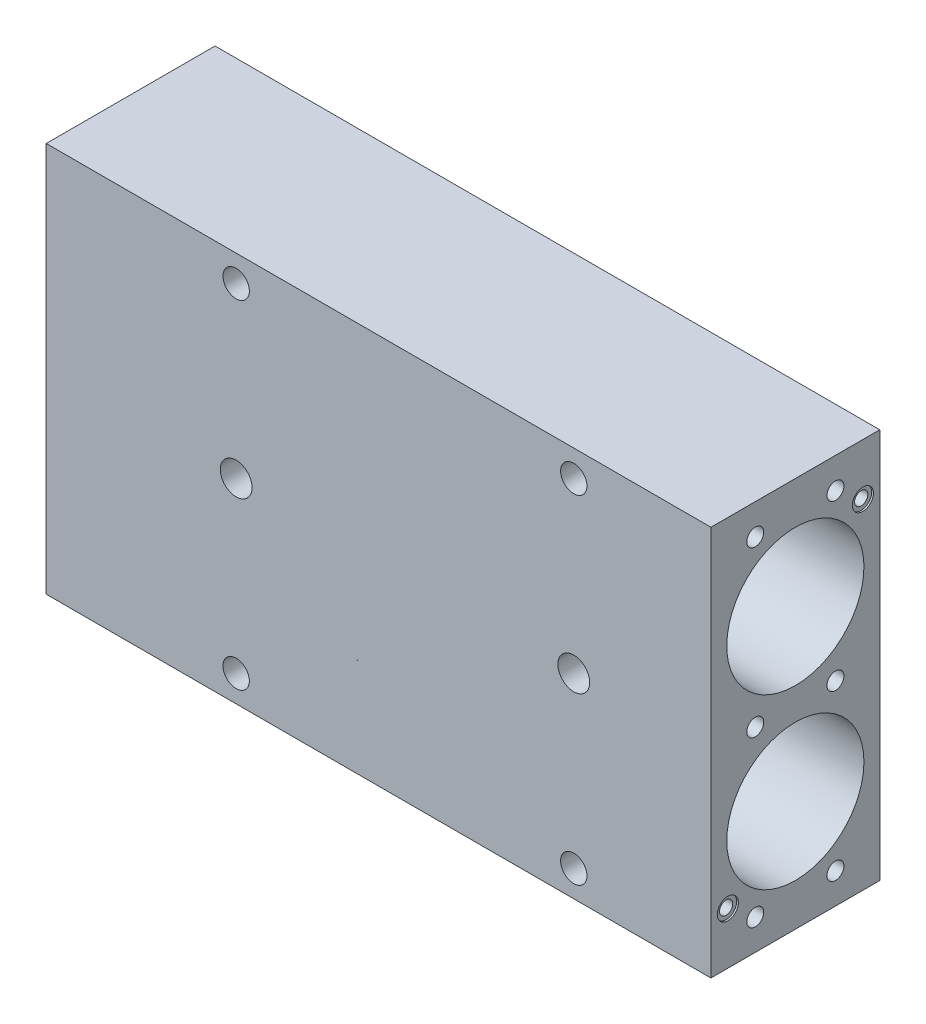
from build123d import *

# Parameters (mm, degrees)
SKETCH1_W                   = 200.025
SKETCH1_H                   = 117.475
EXTRUDE1_DEPTH              = 25.4
SKETCH2_R                   = 27.52725
CUT_EXTRUDE1_DEPTH          = 3.9116
SKETCH3_R                   = 21.59
CUT_EXTRUDE2_DEPTH          = 44.45
SKETCH4_R                   = 12.7
CUT_EXTRUDE3_DEPTH          = 50.038
SKETCH5_R                   = 16.0274
CUT_EXTRUDE4_DEPTH          = 49.53
SKETCH9_R                   = 20.6375
CUT_EXTRUDE6_DEPTH          = 211.012510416
F_3_8_16_TAPPED_HOLE1_D     = 7.9375
F_3_8_16_TAPPED_HOLE1_DEPTH = 19.05
F_3_8_16_TAPPED_HOLE1_TIP   = 2.384665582
SKETCH10_R                  = 4.7879
CUT_EXTRUDE7_DEPTH          = 12.7
F_10_32_TAPPED_HOLE1_D      = 4.0386
F_10_32_TAPPED_HOLE1_DEPTH  = 21.4273892
F_10_32_TAPPED_HOLE1_TIP    = 1.213317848
SKETCH13_R                  = 3.9751
CUT_EXTRUDE8_DEPTH          = 19.05
F_8_32_TAPPED_HOLE1_D       = 3.4544
F_8_32_TAPPED_HOLE1_DEPTH   = 11.90244
F_8_32_TAPPED_HOLE1_TIP     = 1.037806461
F_1_4_20_TAPPED_HOLE1_D     = 5.1054
F_1_4_20_TAPPED_HOLE1_DEPTH = 16.51
F_1_4_20_TAPPED_HOLE1_TIP   = 1.533816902
SKETCH18_R                  = 1.9939
CUT_EXTRUDE9_DEPTH          = 185.42
SKETCH19_R                  = 3.175
CUT_EXTRUDE10_DEPTH         = 0.508
SKETCH20_R                  = 21.43125
CUT_EXTRUDE11_DEPTH         = 15.24


with BuildPart() as part:
    # Sketch1 → Extrude1 (new, symmetric)
    with BuildSketch(Plane.XY):
        with Locations((-7.9375, 0)):
            Rectangle(SKETCH1_W, SKETCH1_H)
    extrude(amount=EXTRUDE1_DEPTH, both=True)

    # Sketch2 → Cut-Extrude1 (cut)
    with BuildSketch(Plane(origin=(0, 0, -25.4), x_dir=(-1, 0, 0), z_dir=(0, 0, -1))):
        Circle(SKETCH2_R)
    extrude(amount=-CUT_EXTRUDE1_DEPTH, mode=Mode.SUBTRACT)

    # Sketch3 → Cut-Extrude2 (cut)
    with BuildSketch(Plane(origin=(0, 0, -25.4), x_dir=(-1, 0, 0), z_dir=(0, 0, -1))):
        Circle(SKETCH3_R)
    extrude(amount=-CUT_EXTRUDE2_DEPTH, mode=Mode.SUBTRACT)

    # Sketch4 → Cut-Extrude3 (cut)
    with BuildSketch(Plane(origin=(0, 0, -25.4), x_dir=(-1, 0, 0), z_dir=(0, 0, -1))):
        Circle(SKETCH4_R)
    extrude(amount=-CUT_EXTRUDE3_DEPTH, mode=Mode.SUBTRACT)

    # Sketch5 → Cut-Extrude4 (cut)
    with BuildSketch(Plane(origin=(0, 0, -25.4), x_dir=(-1, 0, 0), z_dir=(0, 0, -1))):
        Circle(SKETCH5_R)
    extrude(amount=-CUT_EXTRUDE4_DEPTH, mode=Mode.SUBTRACT)

    # Sketch9 → Cut-Extrude6 (cut, through all)
    with BuildSketch(Plane.ZY.offset(107.95)):
        with Locations(Location((0, 25.4, 0), (0, 0, 270))):
            Circle(SKETCH9_R)
        with Locations(Location((0, -25.4, 0), (0, 0, 90))):
            Circle(SKETCH9_R)
    extrude(amount=-CUT_EXTRUDE6_DEPTH, mode=Mode.SUBTRACT)

    # 3_8-16 Tapped Hole1
    with Locations(Plane.XY.offset(25.4)):
        with Locations((-50.8, 50.8), (-50.8, -50.8), (50.8, -50.8), (50.8, 50.8)):
            Hole(F_3_8_16_TAPPED_HOLE1_D / 2, depth=F_3_8_16_TAPPED_HOLE1_DEPTH)
            with Locations((0, 0, -(F_3_8_16_TAPPED_HOLE1_DEPTH + F_3_8_16_TAPPED_HOLE1_TIP / 2))):  # 118° drill point
                Cone(0, F_3_8_16_TAPPED_HOLE1_D / 2, F_3_8_16_TAPPED_HOLE1_TIP, mode=Mode.SUBTRACT)

    # Sketch10 → Cut-Extrude7 (cut)
    with BuildSketch(Plane.XY.offset(25.4)):
        with Locations((-50.8, 0)):
            Circle(SKETCH10_R)
    cut_extrude7 = extrude(amount=-CUT_EXTRUDE7_DEPTH, mode=Mode.SUBTRACT)

    # 10-32 Tapped Hole1
    with Locations(Plane(origin=(30.740391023, 37.143849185, -25.4), x_dir=(1, 0, 0), z_dir=(0, 0, -1))):
        with Locations((-39.630391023, -13.656150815), (-21.850391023, -13.656150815), (20.059608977, 37.143849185), (-21.850391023, 87.943849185), (-39.630391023, 87.943849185), (-67.646591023, 37.143849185), (-81.540391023, 37.143849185)):
            Hole(F_10_32_TAPPED_HOLE1_D / 2, depth=F_10_32_TAPPED_HOLE1_DEPTH)
            with Locations((0, 0, -(F_10_32_TAPPED_HOLE1_DEPTH + F_10_32_TAPPED_HOLE1_TIP / 2))):  # 118° drill point
                Cone(0, F_10_32_TAPPED_HOLE1_D / 2, F_10_32_TAPPED_HOLE1_TIP, mode=Mode.SUBTRACT)

    # Sketch13 → Cut-Extrude8 (cut)
    with BuildSketch(Plane.XY.offset(-25.4)):
        with Locations(Location((36.9062, 0, 0), (0, 0, 180))):
            Circle(SKETCH13_R)
    extrude(amount=CUT_EXTRUDE8_DEPTH, mode=Mode.SUBTRACT)

    # 8-32 Tapped Hole1
    with Locations(Plane(origin=(39.397198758, -44.087211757, -25.4), x_dir=(1, 0, 0), z_dir=(0, 0, -1))):
        with Locations((-2.490998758, -37.737211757), (-2.490998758, -50.437211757)):
            Hole(F_8_32_TAPPED_HOLE1_D / 2, depth=F_8_32_TAPPED_HOLE1_DEPTH)
            with Locations((0, 0, -(F_8_32_TAPPED_HOLE1_DEPTH + F_8_32_TAPPED_HOLE1_TIP / 2))):  # 118° drill point
                Cone(0, F_8_32_TAPPED_HOLE1_D / 2, F_8_32_TAPPED_HOLE1_TIP, mode=Mode.SUBTRACT)

    # 1_4-20 Tapped Hole1
    with Locations(Plane(origin=(92.075, 0, 0), x_dir=(0, 0, -1), z_dir=(1, 0, 0))):
        with Locations((-12.065, 49.53), (12.065, 49.53), (-12.065, 0), (12.065, 0), (12.065, -49.53), (-12.065, -49.53)):
            Hole(F_1_4_20_TAPPED_HOLE1_D / 2, depth=F_1_4_20_TAPPED_HOLE1_DEPTH)
            with Locations((0, 0, -(F_1_4_20_TAPPED_HOLE1_DEPTH + F_1_4_20_TAPPED_HOLE1_TIP / 2))):  # 118° drill point
                Cone(0, F_1_4_20_TAPPED_HOLE1_D / 2, F_1_4_20_TAPPED_HOLE1_TIP, mode=Mode.SUBTRACT)

    # Sketch18 → Cut-Extrude9 (cut)
    with BuildSketch(Plane(origin=(92.075, 0, 0), x_dir=(0, 0, -1), z_dir=(1, 0, 0))):
        with Locations(Location((-20.32, -43.18, 0), (0, 0, 90))):
            Circle(SKETCH18_R)
        with Locations(Location((20.32, 43.18, 0), (0, 0, 90))):
            Circle(SKETCH18_R)
    extrude(amount=-CUT_EXTRUDE9_DEPTH, mode=Mode.SUBTRACT)

    # Sketch19 → Cut-Extrude10 (cut)
    with BuildSketch(Plane(origin=(92.075, 0, 0), x_dir=(0, 0, -1), z_dir=(1, 0, 0))):
        with Locations(Location((-20.32, -43.18, 0), (0, 0, 90))):
            Circle(SKETCH19_R)
        with Locations(Location((20.32, 43.18, 0), (0, 0, 90))):
            Circle(SKETCH19_R)
    extrude(amount=-CUT_EXTRUDE10_DEPTH, mode=Mode.SUBTRACT)

    # Sketch20 → Cut-Extrude11 (cut)
    with BuildSketch(Plane.ZY.offset(107.95)):
        with Locations(Location((0, 25.4, 0), (0, 0, 270))):
            Circle(SKETCH20_R)
        with Locations(Location((0, -25.4, 0), (0, 0, 270))):
            Circle(SKETCH20_R)
    extrude(amount=-CUT_EXTRUDE11_DEPTH, mode=Mode.SUBTRACT)

    # Mirror2: Cut-Extrude7 across plane
    add(cut_extrude7.mirror(Plane(origin=(0, 0, 0), x_dir=(0, 0, 1), z_dir=(1, 0, 0))), mode=Mode.SUBTRACT)


solid = part.part
